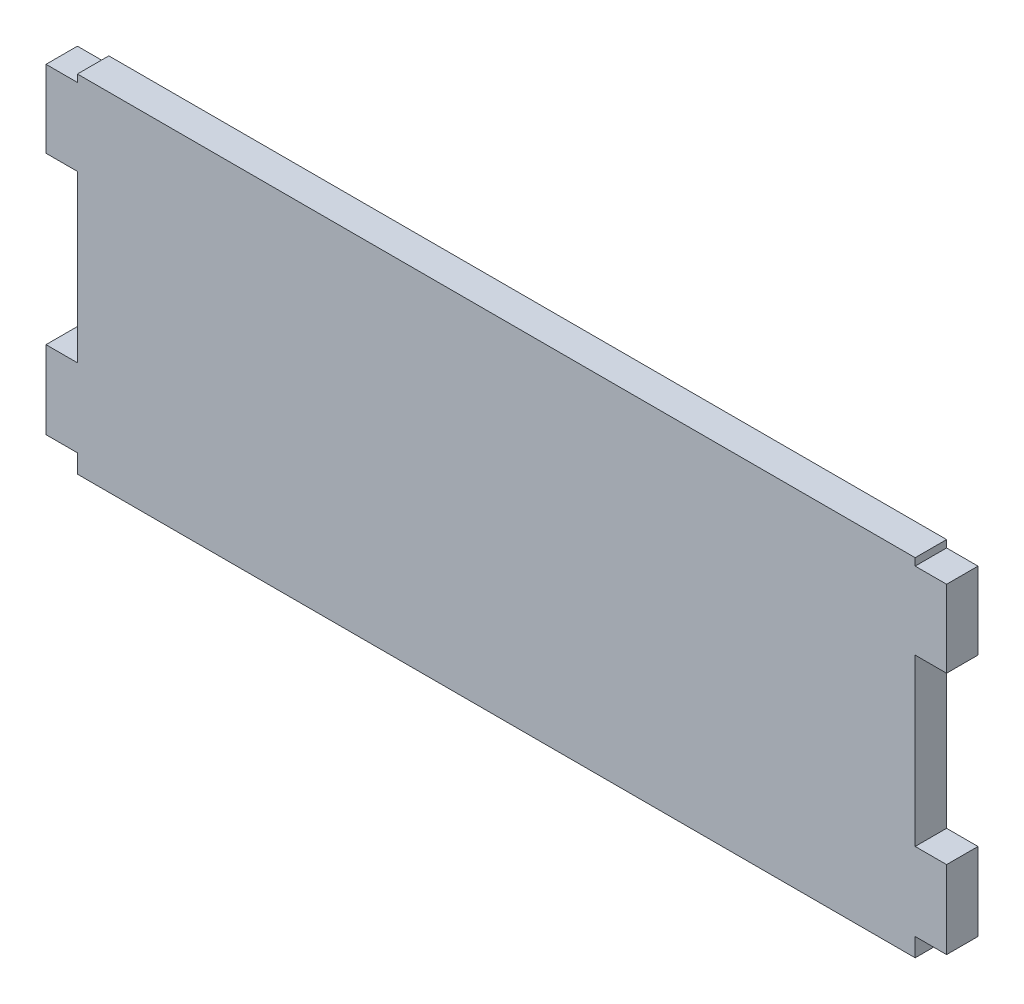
from build123d import *

# Parameters (mm, degrees)
ESQUISSE1_W        = 80
ESQUISSE1_H        = 33.093810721
BOSS_EXTRU_1_DEPTH = 3
ESQUISSE2_W        = 3
ESQUISSE2_H        = 7.359356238
ESQUISSE2_H_2      = 7.446463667
BOSS_EXTRU_2_DEPTH = 3


with BuildPart() as part:
    # Esquisse1 → Boss.-Extru.1 (new body)
    with BuildSketch(Plane.XY):
        with Locations((40, -21.13827448)):
            Rectangle(ESQUISSE1_W, ESQUISSE1_H)
    extrude(amount=BOSS_EXTRU_1_DEPTH)

    # Esquisse2 → Boss.-Extru.2 (add)
    with BuildSketch(Plane.XY.offset(3)):
        with Locations((-1.5, -8.968313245)):
            Rectangle(ESQUISSE2_W, ESQUISSE2_H)
        with Locations((-1.5, -32.196789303)):
            Rectangle(ESQUISSE2_W, ESQUISSE2_H_2)
        with Locations((81.5, -32.196789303)):
            Rectangle(ESQUISSE2_W, ESQUISSE2_H_2)
        with Locations((81.5, -8.968313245)):
            Rectangle(ESQUISSE2_W, ESQUISSE2_H)
    extrude(amount=-BOSS_EXTRU_2_DEPTH)


solid = part.part
